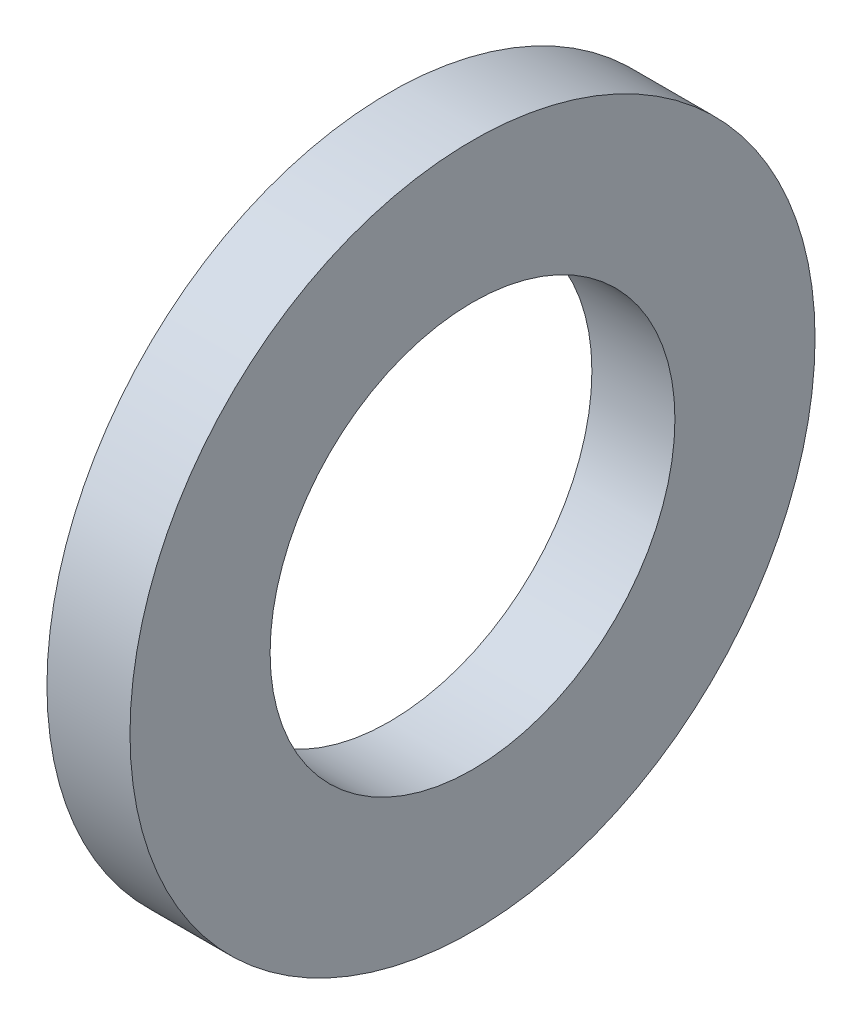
from build123d import *

# Parameters (mm, degrees)
SKETCH1_R          = 33
SKETCH1_R_2        = 19.5
BASE_EXTRUDE_DEPTH = 8


with BuildPart() as part:
    # Sketch1 → Base-Extrude (new body)
    with BuildSketch(Plane(origin=(0, 0, 0), x_dir=(0, 0, -1), z_dir=(1, 0, 0))):
        Circle(SKETCH1_R)
        Circle(SKETCH1_R_2, mode=Mode.SUBTRACT)
    extrude(amount=BASE_EXTRUDE_DEPTH)


solid = part.part
